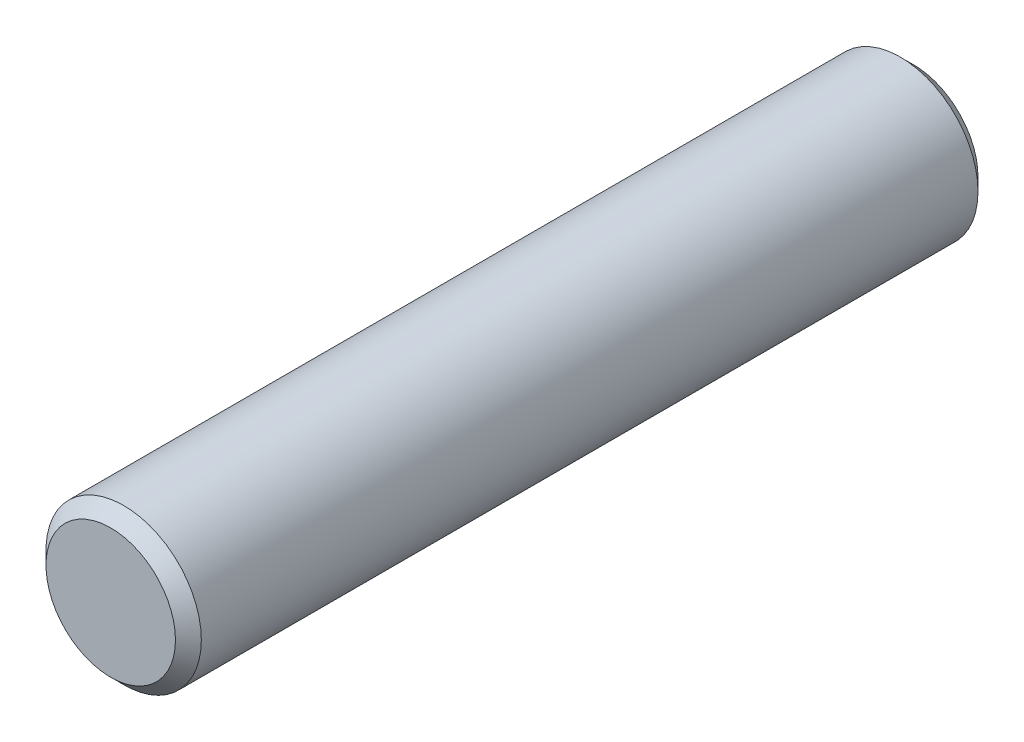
from build123d import *

# Parameters (mm, degrees)
ESQUISSE1_R      = 3
EXTRUSION1_DEPTH = 31
CHANFREIN1_SIZE  = 0.5


with BuildPart() as part:
    # Esquisse1 → Extrusion1 (new body)
    with BuildSketch(Plane.XY):
        Circle(ESQUISSE1_R)
    extrude(amount=EXTRUSION1_DEPTH)

    # Chanfrein1
    chanfrein1_edges = [part.edges().sort_by_distance(p)[0] for p in [
        (-3, 0, 0),
        (-3, 0, 31),
    ]]
    chamfer(chanfrein1_edges, length=CHANFREIN1_SIZE)


solid = part.part
